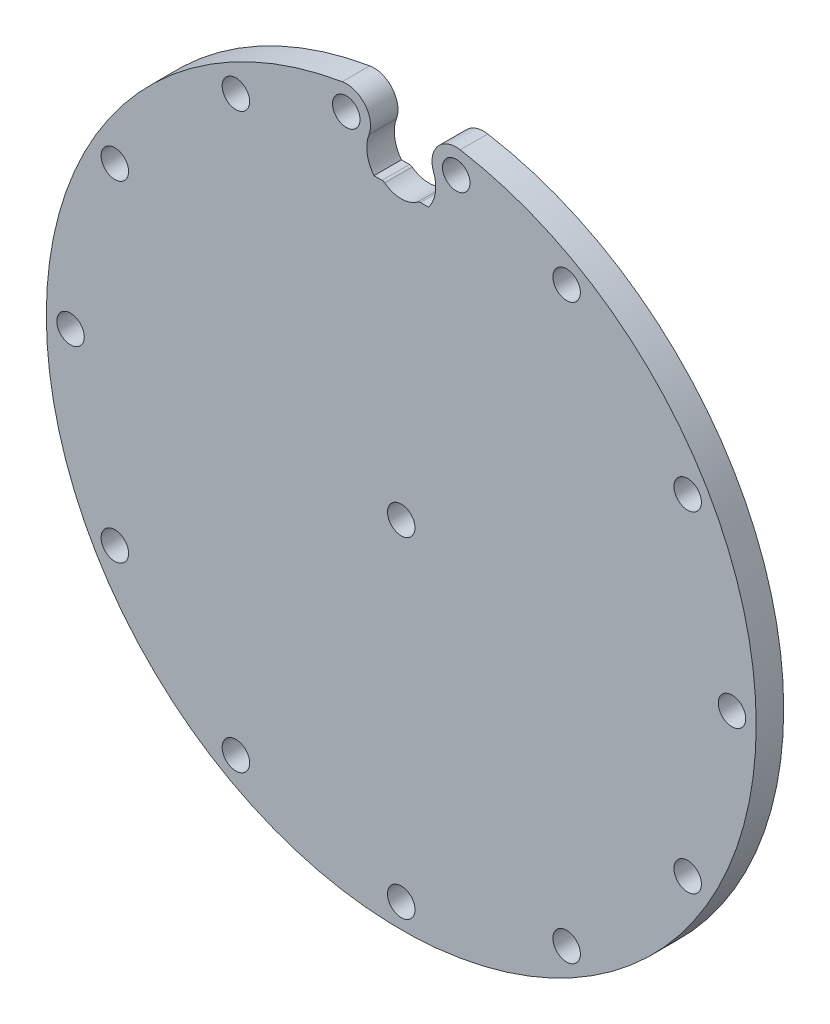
ISO-10303-21;
HEADER;
FILE_DESCRIPTION(('STEP AP214'),'2;1');
FILE_NAME('part.step','',(''),(''),'','','');
FILE_SCHEMA(('AUTOMOTIVE_DESIGN { 1 0 10303 214 1 1 1 1 }'));
ENDSEC;
DATA;
#1=APPLICATION_CONTEXT('core data for automotive mechanical design processes');
#2=APPLICATION_PROTOCOL_DEFINITION('international standard','automotive_design',2000,#1);
#3=PRODUCT_CONTEXT('',#1,'mechanical');
#4=PRODUCT('Part','Part','',(#3));
#5=PRODUCT_RELATED_PRODUCT_CATEGORY('part','',(#4));
#6=PRODUCT_DEFINITION_FORMATION('','',#4);
#7=PRODUCT_DEFINITION_CONTEXT('part definition',#1,'design');
#8=PRODUCT_DEFINITION('design','',#6,#7);
#9=PRODUCT_DEFINITION_SHAPE('','',#8);
#10=(LENGTH_UNIT() NAMED_UNIT(*) SI_UNIT(.MILLI.,.METRE.));
#11=(NAMED_UNIT(*) PLANE_ANGLE_UNIT() SI_UNIT($,.RADIAN.));
#12=(NAMED_UNIT(*) SI_UNIT($,.STERADIAN.) SOLID_ANGLE_UNIT());
#13=UNCERTAINTY_MEASURE_WITH_UNIT(LENGTH_MEASURE(1.E-05),#10,'distance_accuracy_value','');
#14=(GEOMETRIC_REPRESENTATION_CONTEXT(3) GLOBAL_UNCERTAINTY_ASSIGNED_CONTEXT((#13)) GLOBAL_UNIT_ASSIGNED_CONTEXT((#10,
#11,#12)) REPRESENTATION_CONTEXT('',''));
#15=CARTESIAN_POINT('',(0.,0.,0.));
#16=DIRECTION('',(0.,0.,1.));
#17=DIRECTION('',(1.,0.,0.));
#18=AXIS2_PLACEMENT_3D('',#15,#16,#17);
#19=CARTESIAN_POINT('',(-6.35000000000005,37.6685213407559,3.175));
#20=DIRECTION('',(0.,0.,1.));
#21=DIRECTION('',(1.,0.,0.));
#22=AXIS2_PLACEMENT_3D('',#19,#20,#21);
#23=PLANE('',#22);
#24=CARTESIAN_POINT('',(6.35,37.6685213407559,3.175));
#25=DIRECTION('',(0.,0.,1.));
#26=DIRECTION('',(1.,0.,0.));
#27=AXIS2_PLACEMENT_3D('',#24,#25,#26);
#28=CIRCLE('',#27,1.5875000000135);
#29=CARTESIAN_POINT('',(7.9375000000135,37.6685213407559,3.175));
#30=VERTEX_POINT('',#29);
#31=EDGE_CURVE('E479',#30,#30,#28,.T.);
#32=ORIENTED_EDGE('',*,*,#31,.F.);
#33=EDGE_LOOP('',(#32));
#34=FACE_BOUND('',#33,.T.);
#35=CARTESIAN_POINT('',(33.0821704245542,19.0999999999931,3.175));
#36=DIRECTION('',(0.,0.,1.));
#37=DIRECTION('',(1.,0.,0.));
#38=AXIS2_PLACEMENT_3D('',#35,#36,#37);
#39=CIRCLE('',#38,1.5875000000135);
#40=CARTESIAN_POINT('',(34.6696704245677,19.0999999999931,3.175));
#41=VERTEX_POINT('',#40);
#42=EDGE_CURVE('E491',#41,#41,#39,.T.);
#43=ORIENTED_EDGE('',*,*,#42,.F.);
#44=EDGE_LOOP('',(#43));
#45=FACE_BOUND('',#44,.T.);
#46=CARTESIAN_POINT('',(-33.082170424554,19.0999999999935,3.175));
#47=DIRECTION('',(0.,0.,1.));
#48=DIRECTION('',(1.,0.,0.));
#49=AXIS2_PLACEMENT_3D('',#46,#47,#48);
#50=CIRCLE('',#49,1.58750000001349);
#51=CARTESIAN_POINT('',(-31.4946704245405,19.0999999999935,3.175));
#52=VERTEX_POINT('',#51);
#53=EDGE_CURVE('E503',#52,#52,#50,.T.);
#54=ORIENTED_EDGE('',*,*,#53,.F.);
#55=EDGE_LOOP('',(#54));
#56=FACE_BOUND('',#55,.T.);
#57=CARTESIAN_POINT('',(33.0821704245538,-19.0999999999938,3.175));
#58=DIRECTION('',(0.,0.,1.));
#59=DIRECTION('',(1.,0.,0.));
#60=AXIS2_PLACEMENT_3D('',#57,#58,#59);
#61=CIRCLE('',#60,1.58750000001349);
#62=CARTESIAN_POINT('',(34.6696704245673,-19.0999999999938,3.175));
#63=VERTEX_POINT('',#62);
#64=EDGE_CURVE('E515',#63,#63,#61,.T.);
#65=ORIENTED_EDGE('',*,*,#64,.F.);
#66=EDGE_LOOP('',(#65));
#67=FACE_BOUND('',#66,.T.);
#68=CARTESIAN_POINT('',(0.,-38.1999999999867,3.175));
#69=DIRECTION('',(0.,0.,1.));
#70=DIRECTION('',(1.,0.,0.));
#71=AXIS2_PLACEMENT_3D('',#68,#69,#70);
#72=CIRCLE('',#71,1.58750000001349);
#73=CARTESIAN_POINT('',(1.58750000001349,-38.1999999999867,3.175));
#74=VERTEX_POINT('',#73);
#75=EDGE_CURVE('E527',#74,#74,#72,.T.);
#76=ORIENTED_EDGE('',*,*,#75,.F.);
#77=EDGE_LOOP('',(#76));
#78=FACE_BOUND('',#77,.T.);
#79=CARTESIAN_POINT('',(-33.0821704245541,-19.0999999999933,3.175));
#80=DIRECTION('',(0.,0.,1.));
#81=DIRECTION('',(1.,0.,0.));
#82=AXIS2_PLACEMENT_3D('',#79,#80,#81);
#83=CIRCLE('',#82,1.58750000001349);
#84=CARTESIAN_POINT('',(-31.4946704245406,-19.0999999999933,3.175));
#85=VERTEX_POINT('',#84);
#86=EDGE_CURVE('E539',#85,#85,#83,.T.);
#87=ORIENTED_EDGE('',*,*,#86,.F.);
#88=EDGE_LOOP('',(#87));
#89=FACE_BOUND('',#88,.T.);
#90=CARTESIAN_POINT('',(0.,0.,3.175));
#91=DIRECTION('',(0.,0.,1.));
#92=DIRECTION('',(1.,0.,0.));
#93=AXIS2_PLACEMENT_3D('',#90,#91,#92);
#94=CIRCLE('',#93,1.5875);
#95=CARTESIAN_POINT('',(1.5875,0.,3.175));
#96=VERTEX_POINT('',#95);
#97=EDGE_CURVE('E158',#96,#96,#94,.T.);
#98=ORIENTED_EDGE('',*,*,#97,.F.);
#99=EDGE_LOOP('',(#98));
#100=FACE_BOUND('',#99,.T.);
#101=DIRECTION('',(-1.,0.,0.));
#102=VECTOR('',#101,1.);
#103=CARTESIAN_POINT('',(2.04345907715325,32.8624110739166,3.175));
#104=LINE('',#103,#102);
#105=CARTESIAN_POINT('',(3.15206281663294,32.8624110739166,3.175));
#106=VERTEX_POINT('',#105);
#107=CARTESIAN_POINT('',(2.21827072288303,32.8624110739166,3.175));
#108=VERTEX_POINT('',#107);
#109=EDGE_CURVE('E148',#106,#108,#104,.T.);
#110=ORIENTED_EDGE('',*,*,#109,.T.);
#111=CARTESIAN_POINT('',(2.21827072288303,32.3624110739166,3.175));
#112=DIRECTION('',(0.,0.,1.));
#113=DIRECTION('',(1.,0.,0.));
#114=AXIS2_PLACEMENT_3D('',#111,#112,#113);
#115=CIRCLE('',#114,0.5);
#116=CARTESIAN_POINT('',(1.91646518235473,32.7610505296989,3.175));
#117=VERTEX_POINT('',#116);
#118=EDGE_CURVE('E45',#108,#117,#115,.T.);
#119=ORIENTED_EDGE('',*,*,#118,.T.);
#120=CARTESIAN_POINT('',(0.,35.2924110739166,3.175));
#121=DIRECTION('',(0.,0.,-1.));
#122=DIRECTION('',(1.,0.,0.));
#123=AXIS2_PLACEMENT_3D('',#120,#121,#122);
#124=CIRCLE('',#123,3.175);
#125=CARTESIAN_POINT('',(-1.91646518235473,32.7610505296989,3.175));
#126=VERTEX_POINT('',#125);
#127=EDGE_CURVE('E150',#117,#126,#124,.T.);
#128=ORIENTED_EDGE('',*,*,#127,.T.);
#129=CARTESIAN_POINT('',(-2.21827072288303,32.3624110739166,3.175));
#130=DIRECTION('',(0.,0.,1.));
#131=DIRECTION('',(1.,0.,0.));
#132=AXIS2_PLACEMENT_3D('',#129,#130,#131);
#133=CIRCLE('',#132,0.5);
#134=CARTESIAN_POINT('',(-2.21827072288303,32.8624110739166,3.175));
#135=VERTEX_POINT('',#134);
#136=EDGE_CURVE('E52',#126,#135,#133,.T.);
#137=ORIENTED_EDGE('',*,*,#136,.T.);
#138=DIRECTION('',(-1.,0.,0.));
#139=VECTOR('',#138,1.);
#140=CARTESIAN_POINT('',(-2.04345907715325,32.8624110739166,3.175));
#141=LINE('',#140,#139);
#142=CARTESIAN_POINT('',(-3.15206281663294,32.8624110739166,3.175));
#143=VERTEX_POINT('',#142);
#144=EDGE_CURVE('E152',#135,#143,#141,.T.);
#145=ORIENTED_EDGE('',*,*,#144,.T.);
#146=CARTESIAN_POINT('',(0.,35.2924110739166,3.175));
#147=DIRECTION('',(0.,0.,-1.));
#148=DIRECTION('',(1.,0.,0.));
#149=AXIS2_PLACEMENT_3D('',#146,#147,#148);
#150=CIRCLE('',#149,3.98);
#151=CARTESIAN_POINT('',(-3.72758112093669,36.6872368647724,3.175));
#152=VERTEX_POINT('',#151);
#153=EDGE_CURVE('E122',#143,#152,#150,.T.);
#154=ORIENTED_EDGE('',*,*,#153,.T.);
#155=CARTESIAN_POINT('',(-6.35000000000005,37.6685213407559,3.175));
#156=DIRECTION('',(0.,0.,1.));
#157=DIRECTION('',(1.,0.,0.));
#158=AXIS2_PLACEMENT_3D('',#155,#156,#157);
#159=CIRCLE('',#158,2.80000000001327);
#160=CARTESIAN_POINT('',(-6.81544502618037,40.4295647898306,3.175));
#161=VERTEX_POINT('',#160);
#162=EDGE_CURVE('E115',#152,#161,#159,.T.);
#163=ORIENTED_EDGE('',*,*,#162,.T.);
#164=CARTESIAN_POINT('',(0.,0.,3.175));
#165=DIRECTION('',(0.,0.,1.));
#166=DIRECTION('',(1.,0.,0.));
#167=AXIS2_PLACEMENT_3D('',#164,#165,#166);
#168=CIRCLE('',#167,41.);
#169=CARTESIAN_POINT('',(6.81544502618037,40.4295647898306,3.175));
#170=VERTEX_POINT('',#169);
#171=EDGE_CURVE('E119',#161,#170,#168,.T.);
#172=ORIENTED_EDGE('',*,*,#171,.T.);
#173=CARTESIAN_POINT('',(6.35,37.6685213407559,3.175));
#174=DIRECTION('',(0.,0.,1.));
#175=DIRECTION('',(1.,0.,0.));
#176=AXIS2_PLACEMENT_3D('',#173,#174,#175);
#177=CIRCLE('',#176,2.80000000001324);
#178=CARTESIAN_POINT('',(3.72758112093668,36.6872368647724,3.175));
#179=VERTEX_POINT('',#178);
#180=EDGE_CURVE('E141',#170,#179,#177,.T.);
#181=ORIENTED_EDGE('',*,*,#180,.T.);
#182=CARTESIAN_POINT('',(0.,35.2924110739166,3.175));
#183=DIRECTION('',(0.,0.,-1.));
#184=DIRECTION('',(1.,0.,0.));
#185=AXIS2_PLACEMENT_3D('',#182,#183,#184);
#186=CIRCLE('',#185,3.98);
#187=EDGE_CURVE('E143',#179,#106,#186,.T.);
#188=ORIENTED_EDGE('',*,*,#187,.T.);
#189=EDGE_LOOP('',(#110,#119,#128,#137,#145,#154,#163,#172,#181,#188));
#190=FACE_BOUND('',#189,.T.);
#191=CARTESIAN_POINT('',(-38.1999999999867,1.33374587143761E-13,3.175));
#192=DIRECTION('',(0.,0.,1.));
#193=DIRECTION('',(1.,0.,0.));
#194=AXIS2_PLACEMENT_3D('',#191,#192,#193);
#195=CIRCLE('',#194,1.58750000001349);
#196=CARTESIAN_POINT('',(-36.6124999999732,1.33374587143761E-13,3.175));
#197=VERTEX_POINT('',#196);
#198=EDGE_CURVE('E545',#197,#197,#195,.T.);
#199=ORIENTED_EDGE('',*,*,#198,.F.);
#200=EDGE_LOOP('',(#199));
#201=FACE_BOUND('',#200,.T.);
#202=CARTESIAN_POINT('',(-19.0999999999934,-33.082170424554,3.175));
#203=DIRECTION('',(0.,0.,1.));
#204=DIRECTION('',(1.,0.,0.));
#205=AXIS2_PLACEMENT_3D('',#202,#203,#204);
#206=CIRCLE('',#205,1.58750000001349);
#207=CARTESIAN_POINT('',(-17.5124999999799,-33.082170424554,3.175));
#208=VERTEX_POINT('',#207);
#209=EDGE_CURVE('E533',#208,#208,#206,.T.);
#210=ORIENTED_EDGE('',*,*,#209,.F.);
#211=EDGE_LOOP('',(#210));
#212=FACE_BOUND('',#211,.T.);
#213=CARTESIAN_POINT('',(19.0999999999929,-33.0821704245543,3.175));
#214=DIRECTION('',(0.,0.,1.));
#215=DIRECTION('',(1.,0.,0.));
#216=AXIS2_PLACEMENT_3D('',#213,#214,#215);
#217=CIRCLE('',#216,1.58750000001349);
#218=CARTESIAN_POINT('',(20.6875000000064,-33.0821704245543,3.175));
#219=VERTEX_POINT('',#218);
#220=EDGE_CURVE('E521',#219,#219,#217,.T.);
#221=ORIENTED_EDGE('',*,*,#220,.F.);
#222=EDGE_LOOP('',(#221));
#223=FACE_BOUND('',#222,.T.);
#224=CARTESIAN_POINT('',(38.1999999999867,-4.00123761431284E-13,3.175));
#225=DIRECTION('',(0.,0.,1.));
#226=DIRECTION('',(1.,0.,0.));
#227=AXIS2_PLACEMENT_3D('',#224,#225,#226);
#228=CIRCLE('',#227,1.58750000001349);
#229=CARTESIAN_POINT('',(39.7875000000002,-4.00123761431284E-13,3.175));
#230=VERTEX_POINT('',#229);
#231=EDGE_CURVE('E509',#230,#230,#228,.T.);
#232=ORIENTED_EDGE('',*,*,#231,.F.);
#233=EDGE_LOOP('',(#232));
#234=FACE_BOUND('',#233,.T.);
#235=CARTESIAN_POINT('',(-19.0999999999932,33.0821704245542,3.175));
#236=DIRECTION('',(0.,0.,1.));
#237=DIRECTION('',(1.,0.,0.));
#238=AXIS2_PLACEMENT_3D('',#235,#236,#237);
#239=CIRCLE('',#238,1.5875000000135);
#240=CARTESIAN_POINT('',(-17.5124999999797,33.0821704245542,3.175));
#241=VERTEX_POINT('',#240);
#242=EDGE_CURVE('E497',#241,#241,#239,.T.);
#243=ORIENTED_EDGE('',*,*,#242,.F.);
#244=EDGE_LOOP('',(#243));
#245=FACE_BOUND('',#244,.T.);
#246=CARTESIAN_POINT('',(19.0999999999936,33.0821704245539,3.175));
#247=DIRECTION('',(0.,0.,1.));
#248=DIRECTION('',(1.,0.,0.));
#249=AXIS2_PLACEMENT_3D('',#246,#247,#248);
#250=CIRCLE('',#249,1.58750000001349);
#251=CARTESIAN_POINT('',(20.6875000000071,33.0821704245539,3.175));
#252=VERTEX_POINT('',#251);
#253=EDGE_CURVE('E485',#252,#252,#250,.T.);
#254=ORIENTED_EDGE('',*,*,#253,.F.);
#255=EDGE_LOOP('',(#254));
#256=FACE_BOUND('',#255,.T.);
#257=CARTESIAN_POINT('',(-6.35000000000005,37.6685213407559,3.175));
#258=DIRECTION('',(0.,0.,1.));
#259=DIRECTION('',(1.,0.,0.));
#260=AXIS2_PLACEMENT_3D('',#257,#258,#259);
#261=CIRCLE('',#260,1.58750000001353);
#262=CARTESIAN_POINT('',(-4.76249999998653,37.6685213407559,3.175));
#263=VERTEX_POINT('',#262);
#264=EDGE_CURVE('E470',#263,#263,#261,.T.);
#265=ORIENTED_EDGE('',*,*,#264,.F.);
#266=EDGE_LOOP('',(#265));
#267=FACE_BOUND('',#266,.T.);
#268=ADVANCED_FACE('F37',(#34,#45,#56,#67,#78,#89,#100,#190,#201,#212,#223,#234,#245,#256,#267),
#23,.T.);
#269=CARTESIAN_POINT('',(-6.35000000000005,37.6685213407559,0.));
#270=DIRECTION('',(0.,0.,1.));
#271=DIRECTION('',(1.,0.,0.));
#272=AXIS2_PLACEMENT_3D('',#269,#270,#271);
#273=PLANE('',#272);
#274=CARTESIAN_POINT('',(0.,35.2924110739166,0.));
#275=DIRECTION('',(0.,0.,-1.));
#276=DIRECTION('',(1.,0.,0.));
#277=AXIS2_PLACEMENT_3D('',#274,#275,#276);
#278=CIRCLE('',#277,3.175);
#279=CARTESIAN_POINT('',(1.91646518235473,32.7610505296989,0.));
#280=VERTEX_POINT('',#279);
#281=CARTESIAN_POINT('',(-1.91646518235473,32.7610505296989,0.));
#282=VERTEX_POINT('',#281);
#283=EDGE_CURVE('E166',#280,#282,#278,.T.);
#284=ORIENTED_EDGE('',*,*,#283,.F.);
#285=CARTESIAN_POINT('',(2.21827072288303,32.3624110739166,0.));
#286=DIRECTION('',(0.,0.,1.));
#287=DIRECTION('',(1.,0.,0.));
#288=AXIS2_PLACEMENT_3D('',#285,#286,#287);
#289=CIRCLE('',#288,0.5);
#290=CARTESIAN_POINT('',(2.21827072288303,32.8624110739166,0.));
#291=VERTEX_POINT('',#290);
#292=EDGE_CURVE('E190',#280,#291,#289,.F.);
#293=ORIENTED_EDGE('',*,*,#292,.T.);
#294=DIRECTION('',(-1.,0.,0.));
#295=VECTOR('',#294,1.);
#296=CARTESIAN_POINT('',(2.04345907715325,32.8624110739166,0.));
#297=LINE('',#296,#295);
#298=CARTESIAN_POINT('',(3.15206281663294,32.8624110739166,0.));
#299=VERTEX_POINT('',#298);
#300=EDGE_CURVE('E164',#299,#291,#297,.T.);
#301=ORIENTED_EDGE('',*,*,#300,.F.);
#302=CARTESIAN_POINT('',(0.,35.2924110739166,0.));
#303=DIRECTION('',(0.,0.,-1.));
#304=DIRECTION('',(1.,0.,0.));
#305=AXIS2_PLACEMENT_3D('',#302,#303,#304);
#306=CIRCLE('',#305,3.98);
#307=CARTESIAN_POINT('',(3.72758112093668,36.6872368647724,0.));
#308=VERTEX_POINT('',#307);
#309=EDGE_CURVE('E162',#308,#299,#306,.T.);
#310=ORIENTED_EDGE('',*,*,#309,.F.);
#311=CARTESIAN_POINT('',(6.35,37.6685213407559,0.));
#312=DIRECTION('',(0.,0.,1.));
#313=DIRECTION('',(1.,0.,0.));
#314=AXIS2_PLACEMENT_3D('',#311,#312,#313);
#315=CIRCLE('',#314,2.80000000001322);
#316=CARTESIAN_POINT('',(6.81544502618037,40.4295647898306,0.));
#317=VERTEX_POINT('',#316);
#318=EDGE_CURVE('E160',#317,#308,#315,.T.);
#319=ORIENTED_EDGE('',*,*,#318,.F.);
#320=CARTESIAN_POINT('',(0.,0.,0.));
#321=DIRECTION('',(0.,0.,1.));
#322=DIRECTION('',(1.,0.,0.));
#323=AXIS2_PLACEMENT_3D('',#320,#321,#322);
#324=CIRCLE('',#323,41.);
#325=CARTESIAN_POINT('',(-6.81544502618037,40.4295647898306,0.));
#326=VERTEX_POINT('',#325);
#327=EDGE_CURVE('E157',#326,#317,#324,.T.);
#328=ORIENTED_EDGE('',*,*,#327,.F.);
#329=CARTESIAN_POINT('',(-6.35000000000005,37.6685213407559,0.));
#330=DIRECTION('',(0.,0.,1.));
#331=DIRECTION('',(1.,0.,0.));
#332=AXIS2_PLACEMENT_3D('',#329,#330,#331);
#333=CIRCLE('',#332,2.80000000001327);
#334=CARTESIAN_POINT('',(-3.72758112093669,36.6872368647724,0.));
#335=VERTEX_POINT('',#334);
#336=EDGE_CURVE('E131',#335,#326,#333,.T.);
#337=ORIENTED_EDGE('',*,*,#336,.F.);
#338=CARTESIAN_POINT('',(0.,35.2924110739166,0.));
#339=DIRECTION('',(0.,0.,-1.));
#340=DIRECTION('',(1.,0.,0.));
#341=AXIS2_PLACEMENT_3D('',#338,#339,#340);
#342=CIRCLE('',#341,3.98);
#343=CARTESIAN_POINT('',(-3.15206281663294,32.8624110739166,0.));
#344=VERTEX_POINT('',#343);
#345=EDGE_CURVE('E126',#344,#335,#342,.T.);
#346=ORIENTED_EDGE('',*,*,#345,.F.);
#347=DIRECTION('',(-1.,0.,0.));
#348=VECTOR('',#347,1.);
#349=CARTESIAN_POINT('',(-2.04345907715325,32.8624110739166,0.));
#350=LINE('',#349,#348);
#351=CARTESIAN_POINT('',(-2.21827072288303,32.8624110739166,0.));
#352=VERTEX_POINT('',#351);
#353=EDGE_CURVE('E169',#352,#344,#350,.T.);
#354=ORIENTED_EDGE('',*,*,#353,.F.);
#355=CARTESIAN_POINT('',(-2.21827072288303,32.3624110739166,0.));
#356=DIRECTION('',(0.,0.,1.));
#357=DIRECTION('',(1.,0.,0.));
#358=AXIS2_PLACEMENT_3D('',#355,#356,#357);
#359=CIRCLE('',#358,0.5);
#360=EDGE_CURVE('E188',#352,#282,#359,.F.);
#361=ORIENTED_EDGE('',*,*,#360,.T.);
#362=EDGE_LOOP('',(#284,#293,#301,#310,#319,#328,#337,#346,#354,#361));
#363=FACE_BOUND('',#362,.T.);
#364=CARTESIAN_POINT('',(0.,0.,0.));
#365=DIRECTION('',(0.,0.,1.));
#366=DIRECTION('',(1.,0.,0.));
#367=AXIS2_PLACEMENT_3D('',#364,#365,#366);
#368=CIRCLE('',#367,1.5875);
#369=CARTESIAN_POINT('',(1.5875,0.,0.));
#370=VERTEX_POINT('',#369);
#371=EDGE_CURVE('E548',#370,#370,#368,.T.);
#372=ORIENTED_EDGE('',*,*,#371,.T.);
#373=EDGE_LOOP('',(#372));
#374=FACE_BOUND('',#373,.T.);
#375=CARTESIAN_POINT('',(-38.1999999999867,1.33374587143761E-13,0.));
#376=DIRECTION('',(0.,0.,1.));
#377=DIRECTION('',(1.,0.,0.));
#378=AXIS2_PLACEMENT_3D('',#375,#376,#377);
#379=CIRCLE('',#378,1.58750000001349);
#380=CARTESIAN_POINT('',(-36.6124999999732,1.33374587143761E-13,0.));
#381=VERTEX_POINT('',#380);
#382=EDGE_CURVE('E542',#381,#381,#379,.T.);
#383=ORIENTED_EDGE('',*,*,#382,.T.);
#384=EDGE_LOOP('',(#383));
#385=FACE_BOUND('',#384,.T.);
#386=CARTESIAN_POINT('',(-33.0821704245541,-19.0999999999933,0.));
#387=DIRECTION('',(0.,0.,1.));
#388=DIRECTION('',(1.,0.,0.));
#389=AXIS2_PLACEMENT_3D('',#386,#387,#388);
#390=CIRCLE('',#389,1.58750000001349);
#391=CARTESIAN_POINT('',(-31.4946704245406,-19.0999999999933,0.));
#392=VERTEX_POINT('',#391);
#393=EDGE_CURVE('E536',#392,#392,#390,.T.);
#394=ORIENTED_EDGE('',*,*,#393,.T.);
#395=EDGE_LOOP('',(#394));
#396=FACE_BOUND('',#395,.T.);
#397=CARTESIAN_POINT('',(-19.0999999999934,-33.082170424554,0.));
#398=DIRECTION('',(0.,0.,1.));
#399=DIRECTION('',(1.,0.,0.));
#400=AXIS2_PLACEMENT_3D('',#397,#398,#399);
#401=CIRCLE('',#400,1.58750000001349);
#402=CARTESIAN_POINT('',(-17.5124999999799,-33.082170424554,0.));
#403=VERTEX_POINT('',#402);
#404=EDGE_CURVE('E530',#403,#403,#401,.T.);
#405=ORIENTED_EDGE('',*,*,#404,.T.);
#406=EDGE_LOOP('',(#405));
#407=FACE_BOUND('',#406,.T.);
#408=CARTESIAN_POINT('',(0.,-38.1999999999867,0.));
#409=DIRECTION('',(0.,0.,1.));
#410=DIRECTION('',(1.,0.,0.));
#411=AXIS2_PLACEMENT_3D('',#408,#409,#410);
#412=CIRCLE('',#411,1.58750000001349);
#413=CARTESIAN_POINT('',(1.58750000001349,-38.1999999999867,0.));
#414=VERTEX_POINT('',#413);
#415=EDGE_CURVE('E524',#414,#414,#412,.T.);
#416=ORIENTED_EDGE('',*,*,#415,.T.);
#417=EDGE_LOOP('',(#416));
#418=FACE_BOUND('',#417,.T.);
#419=CARTESIAN_POINT('',(19.0999999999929,-33.0821704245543,0.));
#420=DIRECTION('',(0.,0.,1.));
#421=DIRECTION('',(1.,0.,0.));
#422=AXIS2_PLACEMENT_3D('',#419,#420,#421);
#423=CIRCLE('',#422,1.58750000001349);
#424=CARTESIAN_POINT('',(20.6875000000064,-33.0821704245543,0.));
#425=VERTEX_POINT('',#424);
#426=EDGE_CURVE('E518',#425,#425,#423,.T.);
#427=ORIENTED_EDGE('',*,*,#426,.T.);
#428=EDGE_LOOP('',(#427));
#429=FACE_BOUND('',#428,.T.);
#430=CARTESIAN_POINT('',(33.0821704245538,-19.0999999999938,0.));
#431=DIRECTION('',(0.,0.,1.));
#432=DIRECTION('',(1.,0.,0.));
#433=AXIS2_PLACEMENT_3D('',#430,#431,#432);
#434=CIRCLE('',#433,1.58750000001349);
#435=CARTESIAN_POINT('',(34.6696704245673,-19.0999999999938,0.));
#436=VERTEX_POINT('',#435);
#437=EDGE_CURVE('E512',#436,#436,#434,.T.);
#438=ORIENTED_EDGE('',*,*,#437,.T.);
#439=EDGE_LOOP('',(#438));
#440=FACE_BOUND('',#439,.T.);
#441=CARTESIAN_POINT('',(38.1999999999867,-4.00123761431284E-13,0.));
#442=DIRECTION('',(0.,0.,1.));
#443=DIRECTION('',(1.,0.,0.));
#444=AXIS2_PLACEMENT_3D('',#441,#442,#443);
#445=CIRCLE('',#444,1.58750000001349);
#446=CARTESIAN_POINT('',(39.7875000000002,-4.00123761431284E-13,0.));
#447=VERTEX_POINT('',#446);
#448=EDGE_CURVE('E506',#447,#447,#445,.T.);
#449=ORIENTED_EDGE('',*,*,#448,.T.);
#450=EDGE_LOOP('',(#449));
#451=FACE_BOUND('',#450,.T.);
#452=CARTESIAN_POINT('',(-33.082170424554,19.0999999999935,0.));
#453=DIRECTION('',(0.,0.,1.));
#454=DIRECTION('',(1.,0.,0.));
#455=AXIS2_PLACEMENT_3D('',#452,#453,#454);
#456=CIRCLE('',#455,1.58750000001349);
#457=CARTESIAN_POINT('',(-31.4946704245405,19.0999999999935,0.));
#458=VERTEX_POINT('',#457);
#459=EDGE_CURVE('E500',#458,#458,#456,.T.);
#460=ORIENTED_EDGE('',*,*,#459,.T.);
#461=EDGE_LOOP('',(#460));
#462=FACE_BOUND('',#461,.T.);
#463=CARTESIAN_POINT('',(-19.0999999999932,33.0821704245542,0.));
#464=DIRECTION('',(0.,0.,1.));
#465=DIRECTION('',(1.,0.,0.));
#466=AXIS2_PLACEMENT_3D('',#463,#464,#465);
#467=CIRCLE('',#466,1.5875000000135);
#468=CARTESIAN_POINT('',(-17.5124999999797,33.0821704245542,0.));
#469=VERTEX_POINT('',#468);
#470=EDGE_CURVE('E494',#469,#469,#467,.T.);
#471=ORIENTED_EDGE('',*,*,#470,.T.);
#472=EDGE_LOOP('',(#471));
#473=FACE_BOUND('',#472,.T.);
#474=CARTESIAN_POINT('',(33.0821704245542,19.0999999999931,0.));
#475=DIRECTION('',(0.,0.,1.));
#476=DIRECTION('',(1.,0.,0.));
#477=AXIS2_PLACEMENT_3D('',#474,#475,#476);
#478=CIRCLE('',#477,1.5875000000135);
#479=CARTESIAN_POINT('',(34.6696704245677,19.0999999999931,0.));
#480=VERTEX_POINT('',#479);
#481=EDGE_CURVE('E488',#480,#480,#478,.T.);
#482=ORIENTED_EDGE('',*,*,#481,.T.);
#483=EDGE_LOOP('',(#482));
#484=FACE_BOUND('',#483,.T.);
#485=CARTESIAN_POINT('',(19.0999999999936,33.0821704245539,0.));
#486=DIRECTION('',(0.,0.,1.));
#487=DIRECTION('',(1.,0.,0.));
#488=AXIS2_PLACEMENT_3D('',#485,#486,#487);
#489=CIRCLE('',#488,1.58750000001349);
#490=CARTESIAN_POINT('',(20.6875000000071,33.0821704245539,0.));
#491=VERTEX_POINT('',#490);
#492=EDGE_CURVE('E482',#491,#491,#489,.T.);
#493=ORIENTED_EDGE('',*,*,#492,.T.);
#494=EDGE_LOOP('',(#493));
#495=FACE_BOUND('',#494,.T.);
#496=CARTESIAN_POINT('',(6.35,37.6685213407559,0.));
#497=DIRECTION('',(0.,0.,1.));
#498=DIRECTION('',(1.,0.,0.));
#499=AXIS2_PLACEMENT_3D('',#496,#497,#498);
#500=CIRCLE('',#499,1.5875000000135);
#501=CARTESIAN_POINT('',(7.9375000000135,37.6685213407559,0.));
#502=VERTEX_POINT('',#501);
#503=EDGE_CURVE('E476',#502,#502,#500,.T.);
#504=ORIENTED_EDGE('',*,*,#503,.T.);
#505=EDGE_LOOP('',(#504));
#506=FACE_BOUND('',#505,.T.);
#507=CARTESIAN_POINT('',(-6.35000000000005,37.6685213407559,0.));
#508=DIRECTION('',(0.,0.,1.));
#509=DIRECTION('',(1.,0.,0.));
#510=AXIS2_PLACEMENT_3D('',#507,#508,#509);
#511=CIRCLE('',#510,1.58750000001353);
#512=CARTESIAN_POINT('',(-4.76249999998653,37.6685213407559,0.));
#513=VERTEX_POINT('',#512);
#514=EDGE_CURVE('E473',#513,#513,#511,.T.);
#515=ORIENTED_EDGE('',*,*,#514,.T.);
#516=EDGE_LOOP('',(#515));
#517=FACE_BOUND('',#516,.T.);
#518=ADVANCED_FACE('F204',(#363,#374,#385,#396,#407,#418,#429,#440,#451,#462,#473,#484,#495,
#506,#517),#273,.F.);
#519=CARTESIAN_POINT('',(-6.35000000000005,37.6685213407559,3.175));
#520=DIRECTION('',(0.,0.,-1.));
#521=DIRECTION('',(-1.,0.,0.));
#522=AXIS2_PLACEMENT_3D('',#519,#520,#521);
#523=CYLINDRICAL_SURFACE('',#522,2.80000000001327);
#524=ORIENTED_EDGE('',*,*,#336,.T.);
#525=DIRECTION('',(0.,0.,-1.));
#526=VECTOR('',#525,1.);
#527=CARTESIAN_POINT('',(-6.81544502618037,40.4295647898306,3.175));
#528=LINE('',#527,#526);
#529=EDGE_CURVE('E129',#161,#326,#528,.T.);
#530=ORIENTED_EDGE('',*,*,#529,.F.);
#531=ORIENTED_EDGE('',*,*,#162,.F.);
#532=DIRECTION('',(0.,0.,-1.));
#533=VECTOR('',#532,1.);
#534=CARTESIAN_POINT('',(-3.72758112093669,36.6872368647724,3.175));
#535=LINE('',#534,#533);
#536=EDGE_CURVE('E155',#152,#335,#535,.T.);
#537=ORIENTED_EDGE('',*,*,#536,.T.);
#538=EDGE_LOOP('',(#524,#530,#531,#537));
#539=FACE_BOUND('',#538,.T.);
#540=ADVANCED_FACE('F130',(#539),#523,.T.);
#541=CARTESIAN_POINT('',(0.,0.,3.175));
#542=DIRECTION('',(0.,0.,-1.));
#543=DIRECTION('',(-1.,0.,0.));
#544=AXIS2_PLACEMENT_3D('',#541,#542,#543);
#545=CYLINDRICAL_SURFACE('',#544,41.);
#546=ORIENTED_EDGE('',*,*,#327,.T.);
#547=DIRECTION('',(0.,0.,-1.));
#548=VECTOR('',#547,1.);
#549=CARTESIAN_POINT('',(6.81544502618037,40.4295647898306,3.175));
#550=LINE('',#549,#548);
#551=EDGE_CURVE('E136',#170,#317,#550,.T.);
#552=ORIENTED_EDGE('',*,*,#551,.F.);
#553=ORIENTED_EDGE('',*,*,#171,.F.);
#554=ORIENTED_EDGE('',*,*,#529,.T.);
#555=EDGE_LOOP('',(#546,#552,#553,#554));
#556=FACE_BOUND('',#555,.T.);
#557=ADVANCED_FACE('F138',(#556),#545,.T.);
#558=CARTESIAN_POINT('',(6.35,37.6685213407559,3.175));
#559=DIRECTION('',(0.,0.,-1.));
#560=DIRECTION('',(-1.,0.,0.));
#561=AXIS2_PLACEMENT_3D('',#558,#559,#560);
#562=CYLINDRICAL_SURFACE('',#561,2.80000000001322);
#563=ORIENTED_EDGE('',*,*,#318,.T.);
#564=DIRECTION('',(0.,0.,-1.));
#565=VECTOR('',#564,1.);
#566=CARTESIAN_POINT('',(3.72758112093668,36.6872368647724,3.175));
#567=LINE('',#566,#565);
#568=EDGE_CURVE('E180',#179,#308,#567,.T.);
#569=ORIENTED_EDGE('',*,*,#568,.F.);
#570=ORIENTED_EDGE('',*,*,#180,.F.);
#571=ORIENTED_EDGE('',*,*,#551,.T.);
#572=EDGE_LOOP('',(#563,#569,#570,#571));
#573=FACE_BOUND('',#572,.T.);
#574=ADVANCED_FACE('F214',(#573),#562,.T.);
#575=CARTESIAN_POINT('',(0.,35.2924110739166,3.175));
#576=DIRECTION('',(0.,0.,-1.));
#577=DIRECTION('',(-1.,0.,0.));
#578=AXIS2_PLACEMENT_3D('',#575,#576,#577);
#579=CYLINDRICAL_SURFACE('',#578,3.98);
#580=ORIENTED_EDGE('',*,*,#309,.T.);
#581=DIRECTION('',(0.,0.,-1.));
#582=VECTOR('',#581,1.);
#583=CARTESIAN_POINT('',(3.15206281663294,32.8624110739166,3.175));
#584=LINE('',#583,#582);
#585=EDGE_CURVE('E177',#106,#299,#584,.T.);
#586=ORIENTED_EDGE('',*,*,#585,.F.);
#587=ORIENTED_EDGE('',*,*,#187,.F.);
#588=ORIENTED_EDGE('',*,*,#568,.T.);
#589=EDGE_LOOP('',(#580,#586,#587,#588));
#590=FACE_BOUND('',#589,.T.);
#591=ADVANCED_FACE('F211',(#590),#579,.F.);
#592=CARTESIAN_POINT('',(2.04345907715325,32.8624110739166,3.175));
#593=DIRECTION('',(0.,-1.,0.));
#594=DIRECTION('',(1.,0.,0.));
#595=AXIS2_PLACEMENT_3D('',#592,#593,#594);
#596=PLANE('',#595);
#597=ORIENTED_EDGE('',*,*,#300,.T.);
#598=DIRECTION('',(0.,0.,-1.));
#599=VECTOR('',#598,1.);
#600=CARTESIAN_POINT('',(2.21827072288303,32.8624110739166,3.175));
#601=LINE('',#600,#599);
#602=EDGE_CURVE('E60',#291,#108,#601,.F.);
#603=ORIENTED_EDGE('',*,*,#602,.T.);
#604=ORIENTED_EDGE('',*,*,#109,.F.);
#605=ORIENTED_EDGE('',*,*,#585,.T.);
#606=EDGE_LOOP('',(#597,#603,#604,#605));
#607=FACE_BOUND('',#606,.T.);
#608=ADVANCED_FACE('F207',(#607),#596,.F.);
#609=CARTESIAN_POINT('',(0.,35.2924110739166,3.175));
#610=DIRECTION('',(0.,0.,-1.));
#611=DIRECTION('',(-1.,0.,0.));
#612=AXIS2_PLACEMENT_3D('',#609,#610,#611);
#613=CYLINDRICAL_SURFACE('',#612,3.175);
#614=ORIENTED_EDGE('',*,*,#127,.F.);
#615=DIRECTION('',(0.,0.,-1.));
#616=VECTOR('',#615,1.);
#617=CARTESIAN_POINT('',(1.91646518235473,32.7610505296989,3.175));
#618=LINE('',#617,#616);
#619=EDGE_CURVE('E185',#117,#280,#618,.T.);
#620=ORIENTED_EDGE('',*,*,#619,.T.);
#621=ORIENTED_EDGE('',*,*,#283,.T.);
#622=DIRECTION('',(0.,0.,-1.));
#623=VECTOR('',#622,1.);
#624=CARTESIAN_POINT('',(-1.91646518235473,32.7610505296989,3.175));
#625=LINE('',#624,#623);
#626=EDGE_CURVE('E135',#282,#126,#625,.F.);
#627=ORIENTED_EDGE('',*,*,#626,.T.);
#628=EDGE_LOOP('',(#614,#620,#621,#627));
#629=FACE_BOUND('',#628,.T.);
#630=ADVANCED_FACE('F198',(#629),#613,.F.);
#631=CARTESIAN_POINT('',(-2.04345907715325,32.8624110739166,3.175));
#632=DIRECTION('',(0.,-1.,0.));
#633=DIRECTION('',(1.,0.,0.));
#634=AXIS2_PLACEMENT_3D('',#631,#632,#633);
#635=PLANE('',#634);
#636=ORIENTED_EDGE('',*,*,#144,.F.);
#637=DIRECTION('',(0.,0.,-1.));
#638=VECTOR('',#637,1.);
#639=CARTESIAN_POINT('',(-2.21827072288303,32.8624110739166,3.175));
#640=LINE('',#639,#638);
#641=EDGE_CURVE('E11',#135,#352,#640,.T.);
#642=ORIENTED_EDGE('',*,*,#641,.T.);
#643=ORIENTED_EDGE('',*,*,#353,.T.);
#644=DIRECTION('',(0.,0.,-1.));
#645=VECTOR('',#644,1.);
#646=CARTESIAN_POINT('',(-3.15206281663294,32.8624110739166,3.175));
#647=LINE('',#646,#645);
#648=EDGE_CURVE('E174',#143,#344,#647,.T.);
#649=ORIENTED_EDGE('',*,*,#648,.F.);
#650=EDGE_LOOP('',(#636,#642,#643,#649));
#651=FACE_BOUND('',#650,.T.);
#652=ADVANCED_FACE('F239',(#651),#635,.F.);
#653=CARTESIAN_POINT('',(0.,35.2924110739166,3.175));
#654=DIRECTION('',(0.,0.,-1.));
#655=DIRECTION('',(-1.,0.,0.));
#656=AXIS2_PLACEMENT_3D('',#653,#654,#655);
#657=CYLINDRICAL_SURFACE('',#656,3.98);
#658=ORIENTED_EDGE('',*,*,#345,.T.);
#659=ORIENTED_EDGE('',*,*,#536,.F.);
#660=ORIENTED_EDGE('',*,*,#153,.F.);
#661=ORIENTED_EDGE('',*,*,#648,.T.);
#662=EDGE_LOOP('',(#658,#659,#660,#661));
#663=FACE_BOUND('',#662,.T.);
#664=ADVANCED_FACE('F236',(#663),#657,.F.);
#665=CARTESIAN_POINT('',(0.,0.,3.175));
#666=DIRECTION('',(0.,0.,-1.));
#667=DIRECTION('',(-1.,0.,0.));
#668=AXIS2_PLACEMENT_3D('',#665,#666,#667);
#669=CYLINDRICAL_SURFACE('',#668,1.5875);
#670=ORIENTED_EDGE('',*,*,#97,.T.);
#671=EDGE_LOOP('',(#670));
#672=FACE_BOUND('',#671,.T.);
#673=ORIENTED_EDGE('',*,*,#371,.F.);
#674=EDGE_LOOP('',(#673));
#675=FACE_BOUND('',#674,.T.);
#676=ADVANCED_FACE('F233',(#672,#675),#669,.F.);
#677=CARTESIAN_POINT('',(-38.1999999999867,1.33374587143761E-13,3.175));
#678=DIRECTION('',(0.,0.,-1.));
#679=DIRECTION('',(-1.,0.,0.));
#680=AXIS2_PLACEMENT_3D('',#677,#678,#679);
#681=CYLINDRICAL_SURFACE('',#680,1.58750000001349);
#682=ORIENTED_EDGE('',*,*,#198,.T.);
#683=EDGE_LOOP('',(#682));
#684=FACE_BOUND('',#683,.T.);
#685=ORIENTED_EDGE('',*,*,#382,.F.);
#686=EDGE_LOOP('',(#685));
#687=FACE_BOUND('',#686,.T.);
#688=ADVANCED_FACE('F271',(#684,#687),#681,.F.);
#689=CARTESIAN_POINT('',(-33.0821704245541,-19.0999999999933,3.175));
#690=DIRECTION('',(0.,0.,-1.));
#691=DIRECTION('',(-1.,0.,0.));
#692=AXIS2_PLACEMENT_3D('',#689,#690,#691);
#693=CYLINDRICAL_SURFACE('',#692,1.58750000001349);
#694=ORIENTED_EDGE('',*,*,#86,.T.);
#695=EDGE_LOOP('',(#694));
#696=FACE_BOUND('',#695,.T.);
#697=ORIENTED_EDGE('',*,*,#393,.F.);
#698=EDGE_LOOP('',(#697));
#699=FACE_BOUND('',#698,.T.);
#700=ADVANCED_FACE('F278',(#696,#699),#693,.F.);
#701=CARTESIAN_POINT('',(-19.0999999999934,-33.082170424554,3.175));
#702=DIRECTION('',(0.,0.,-1.));
#703=DIRECTION('',(-1.,0.,0.));
#704=AXIS2_PLACEMENT_3D('',#701,#702,#703);
#705=CYLINDRICAL_SURFACE('',#704,1.58750000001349);
#706=ORIENTED_EDGE('',*,*,#209,.T.);
#707=EDGE_LOOP('',(#706));
#708=FACE_BOUND('',#707,.T.);
#709=ORIENTED_EDGE('',*,*,#404,.F.);
#710=EDGE_LOOP('',(#709));
#711=FACE_BOUND('',#710,.T.);
#712=ADVANCED_FACE('F285',(#708,#711),#705,.F.);
#713=CARTESIAN_POINT('',(0.,-38.1999999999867,3.175));
#714=DIRECTION('',(0.,0.,-1.));
#715=DIRECTION('',(-1.,0.,0.));
#716=AXIS2_PLACEMENT_3D('',#713,#714,#715);
#717=CYLINDRICAL_SURFACE('',#716,1.58750000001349);
#718=ORIENTED_EDGE('',*,*,#75,.T.);
#719=EDGE_LOOP('',(#718));
#720=FACE_BOUND('',#719,.T.);
#721=ORIENTED_EDGE('',*,*,#415,.F.);
#722=EDGE_LOOP('',(#721));
#723=FACE_BOUND('',#722,.T.);
#724=ADVANCED_FACE('F293',(#720,#723),#717,.F.);
#725=CARTESIAN_POINT('',(19.0999999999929,-33.0821704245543,3.175));
#726=DIRECTION('',(0.,0.,-1.));
#727=DIRECTION('',(-1.,0.,0.));
#728=AXIS2_PLACEMENT_3D('',#725,#726,#727);
#729=CYLINDRICAL_SURFACE('',#728,1.58750000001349);
#730=ORIENTED_EDGE('',*,*,#220,.T.);
#731=EDGE_LOOP('',(#730));
#732=FACE_BOUND('',#731,.T.);
#733=ORIENTED_EDGE('',*,*,#426,.F.);
#734=EDGE_LOOP('',(#733));
#735=FACE_BOUND('',#734,.T.);
#736=ADVANCED_FACE('F301',(#732,#735),#729,.F.);
#737=CARTESIAN_POINT('',(33.0821704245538,-19.0999999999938,3.175));
#738=DIRECTION('',(0.,0.,-1.));
#739=DIRECTION('',(-1.,0.,0.));
#740=AXIS2_PLACEMENT_3D('',#737,#738,#739);
#741=CYLINDRICAL_SURFACE('',#740,1.58750000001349);
#742=ORIENTED_EDGE('',*,*,#64,.T.);
#743=EDGE_LOOP('',(#742));
#744=FACE_BOUND('',#743,.T.);
#745=ORIENTED_EDGE('',*,*,#437,.F.);
#746=EDGE_LOOP('',(#745));
#747=FACE_BOUND('',#746,.T.);
#748=ADVANCED_FACE('F309',(#744,#747),#741,.F.);
#749=CARTESIAN_POINT('',(38.1999999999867,-4.00123761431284E-13,3.175));
#750=DIRECTION('',(0.,0.,-1.));
#751=DIRECTION('',(-1.,0.,0.));
#752=AXIS2_PLACEMENT_3D('',#749,#750,#751);
#753=CYLINDRICAL_SURFACE('',#752,1.58750000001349);
#754=ORIENTED_EDGE('',*,*,#231,.T.);
#755=EDGE_LOOP('',(#754));
#756=FACE_BOUND('',#755,.T.);
#757=ORIENTED_EDGE('',*,*,#448,.F.);
#758=EDGE_LOOP('',(#757));
#759=FACE_BOUND('',#758,.T.);
#760=ADVANCED_FACE('F317',(#756,#759),#753,.F.);
#761=CARTESIAN_POINT('',(-33.082170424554,19.0999999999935,3.175));
#762=DIRECTION('',(0.,0.,-1.));
#763=DIRECTION('',(-1.,0.,0.));
#764=AXIS2_PLACEMENT_3D('',#761,#762,#763);
#765=CYLINDRICAL_SURFACE('',#764,1.58750000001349);
#766=ORIENTED_EDGE('',*,*,#53,.T.);
#767=EDGE_LOOP('',(#766));
#768=FACE_BOUND('',#767,.T.);
#769=ORIENTED_EDGE('',*,*,#459,.F.);
#770=EDGE_LOOP('',(#769));
#771=FACE_BOUND('',#770,.T.);
#772=ADVANCED_FACE('F325',(#768,#771),#765,.F.);
#773=CARTESIAN_POINT('',(-19.0999999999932,33.0821704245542,3.175));
#774=DIRECTION('',(0.,0.,-1.));
#775=DIRECTION('',(-1.,0.,0.));
#776=AXIS2_PLACEMENT_3D('',#773,#774,#775);
#777=CYLINDRICAL_SURFACE('',#776,1.5875000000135);
#778=ORIENTED_EDGE('',*,*,#242,.T.);
#779=EDGE_LOOP('',(#778));
#780=FACE_BOUND('',#779,.T.);
#781=ORIENTED_EDGE('',*,*,#470,.F.);
#782=EDGE_LOOP('',(#781));
#783=FACE_BOUND('',#782,.T.);
#784=ADVANCED_FACE('F333',(#780,#783),#777,.F.);
#785=CARTESIAN_POINT('',(33.0821704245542,19.0999999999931,3.175));
#786=DIRECTION('',(0.,0.,-1.));
#787=DIRECTION('',(-1.,0.,0.));
#788=AXIS2_PLACEMENT_3D('',#785,#786,#787);
#789=CYLINDRICAL_SURFACE('',#788,1.5875000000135);
#790=ORIENTED_EDGE('',*,*,#42,.T.);
#791=EDGE_LOOP('',(#790));
#792=FACE_BOUND('',#791,.T.);
#793=ORIENTED_EDGE('',*,*,#481,.F.);
#794=EDGE_LOOP('',(#793));
#795=FACE_BOUND('',#794,.T.);
#796=ADVANCED_FACE('F341',(#792,#795),#789,.F.);
#797=CARTESIAN_POINT('',(19.0999999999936,33.0821704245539,3.175));
#798=DIRECTION('',(0.,0.,-1.));
#799=DIRECTION('',(-1.,0.,0.));
#800=AXIS2_PLACEMENT_3D('',#797,#798,#799);
#801=CYLINDRICAL_SURFACE('',#800,1.58750000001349);
#802=ORIENTED_EDGE('',*,*,#253,.T.);
#803=EDGE_LOOP('',(#802));
#804=FACE_BOUND('',#803,.T.);
#805=ORIENTED_EDGE('',*,*,#492,.F.);
#806=EDGE_LOOP('',(#805));
#807=FACE_BOUND('',#806,.T.);
#808=ADVANCED_FACE('F349',(#804,#807),#801,.F.);
#809=CARTESIAN_POINT('',(6.35,37.6685213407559,3.175));
#810=DIRECTION('',(0.,0.,-1.));
#811=DIRECTION('',(-1.,0.,0.));
#812=AXIS2_PLACEMENT_3D('',#809,#810,#811);
#813=CYLINDRICAL_SURFACE('',#812,1.5875000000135);
#814=ORIENTED_EDGE('',*,*,#31,.T.);
#815=EDGE_LOOP('',(#814));
#816=FACE_BOUND('',#815,.T.);
#817=ORIENTED_EDGE('',*,*,#503,.F.);
#818=EDGE_LOOP('',(#817));
#819=FACE_BOUND('',#818,.T.);
#820=ADVANCED_FACE('F357',(#816,#819),#813,.F.);
#821=CARTESIAN_POINT('',(-6.35000000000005,37.6685213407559,3.175));
#822=DIRECTION('',(0.,0.,-1.));
#823=DIRECTION('',(-1.,0.,0.));
#824=AXIS2_PLACEMENT_3D('',#821,#822,#823);
#825=CYLINDRICAL_SURFACE('',#824,1.58750000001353);
#826=ORIENTED_EDGE('',*,*,#264,.T.);
#827=EDGE_LOOP('',(#826));
#828=FACE_BOUND('',#827,.T.);
#829=ORIENTED_EDGE('',*,*,#514,.F.);
#830=EDGE_LOOP('',(#829));
#831=FACE_BOUND('',#830,.T.);
#832=ADVANCED_FACE('F365',(#828,#831),#825,.F.);
#833=CARTESIAN_POINT('',(2.21827072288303,32.3624110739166,3.175));
#834=DIRECTION('',(0.,0.,-1.));
#835=DIRECTION('',(-1.,0.,0.));
#836=AXIS2_PLACEMENT_3D('',#833,#834,#835);
#837=CYLINDRICAL_SURFACE('',#836,0.5);
#838=ORIENTED_EDGE('',*,*,#118,.F.);
#839=ORIENTED_EDGE('',*,*,#602,.F.);
#840=ORIENTED_EDGE('',*,*,#292,.F.);
#841=ORIENTED_EDGE('',*,*,#619,.F.);
#842=EDGE_LOOP('',(#838,#839,#840,#841));
#843=FACE_BOUND('',#842,.T.);
#844=ADVANCED_FACE('F201',(#843),#837,.T.);
#845=CARTESIAN_POINT('',(-2.21827072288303,32.3624110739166,3.175));
#846=DIRECTION('',(0.,0.,-1.));
#847=DIRECTION('',(-1.,0.,0.));
#848=AXIS2_PLACEMENT_3D('',#845,#846,#847);
#849=CYLINDRICAL_SURFACE('',#848,0.5);
#850=ORIENTED_EDGE('',*,*,#136,.F.);
#851=ORIENTED_EDGE('',*,*,#626,.F.);
#852=ORIENTED_EDGE('',*,*,#360,.F.);
#853=ORIENTED_EDGE('',*,*,#641,.F.);
#854=EDGE_LOOP('',(#850,#851,#852,#853));
#855=FACE_BOUND('',#854,.T.);
#856=ADVANCED_FACE('F39',(#855),#849,.T.);
#857=CLOSED_SHELL('',(#268,#518,#540,#557,#574,#591,#608,#630,#652,#664,#676,#688,#700,#712,
#724,#736,#748,#760,#772,#784,#796,#808,#820,#832,#844,#856));
#858=MANIFOLD_SOLID_BREP('B2',#857);
#859=ADVANCED_BREP_SHAPE_REPRESENTATION('',(#18,#858),#14);
#860=SHAPE_DEFINITION_REPRESENTATION(#9,#859);
ENDSEC;
END-ISO-10303-21;
